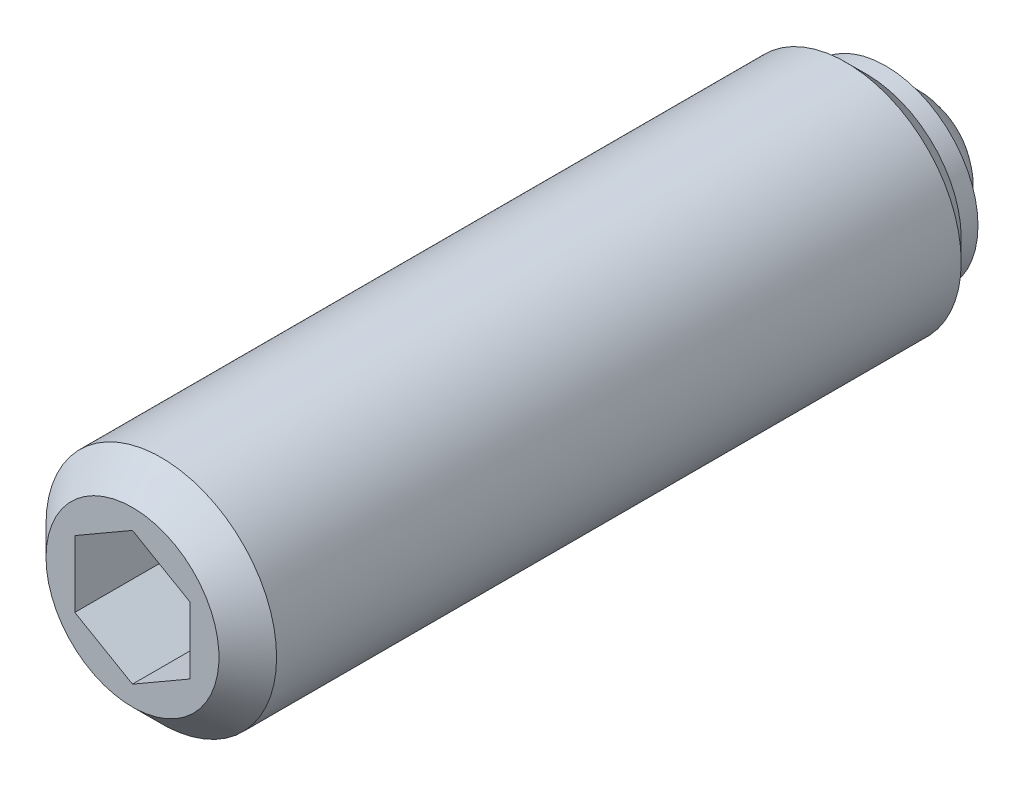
ISO-10303-21;
HEADER;
FILE_DESCRIPTION(('STEP AP214'),'2;1');
FILE_NAME('part.step','',(''),(''),'','','');
FILE_SCHEMA(('AUTOMOTIVE_DESIGN { 1 0 10303 214 1 1 1 1 }'));
ENDSEC;
DATA;
#1=APPLICATION_CONTEXT('core data for automotive mechanical design processes');
#2=APPLICATION_PROTOCOL_DEFINITION('international standard','automotive_design',2000,#1);
#3=PRODUCT_CONTEXT('',#1,'mechanical');
#4=PRODUCT('Part','Part','',(#3));
#5=PRODUCT_RELATED_PRODUCT_CATEGORY('part','',(#4));
#6=PRODUCT_DEFINITION_FORMATION('','',#4);
#7=PRODUCT_DEFINITION_CONTEXT('part definition',#1,'design');
#8=PRODUCT_DEFINITION('design','',#6,#7);
#9=PRODUCT_DEFINITION_SHAPE('','',#8);
#10=(LENGTH_UNIT() NAMED_UNIT(*) SI_UNIT(.MILLI.,.METRE.));
#11=(NAMED_UNIT(*) PLANE_ANGLE_UNIT() SI_UNIT($,.RADIAN.));
#12=(NAMED_UNIT(*) SI_UNIT($,.STERADIAN.) SOLID_ANGLE_UNIT());
#13=UNCERTAINTY_MEASURE_WITH_UNIT(LENGTH_MEASURE(1.E-05),#10,'distance_accuracy_value','');
#14=(GEOMETRIC_REPRESENTATION_CONTEXT(3) GLOBAL_UNCERTAINTY_ASSIGNED_CONTEXT((#13)) GLOBAL_UNIT_ASSIGNED_CONTEXT((#10,
#11,#12)) REPRESENTATION_CONTEXT('',''));
#15=CARTESIAN_POINT('',(0.,0.,0.));
#16=DIRECTION('',(0.,0.,1.));
#17=DIRECTION('',(1.,0.,0.));
#18=AXIS2_PLACEMENT_3D('',#15,#16,#17);
#19=CARTESIAN_POINT('',(0.,0.,34.));
#20=DIRECTION('',(0.,0.,-1.));
#21=DIRECTION('',(-1.,0.,0.));
#22=AXIS2_PLACEMENT_3D('',#19,#20,#21);
#23=PLANE('',#22);
#24=DIRECTION('',(0.,1.,0.));
#25=VECTOR('',#24,1.);
#26=CARTESIAN_POINT('',(-3.,-1.73205080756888,34.));
#27=LINE('',#26,#25);
#28=CARTESIAN_POINT('',(-3.,-1.73205080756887,34.));
#29=VERTEX_POINT('',#28);
#30=CARTESIAN_POINT('',(-3.,1.73205080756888,34.));
#31=VERTEX_POINT('',#30);
#32=EDGE_CURVE('E80',#29,#31,#27,.T.);
#33=ORIENTED_EDGE('',*,*,#32,.F.);
#34=DIRECTION('',(0.866025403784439,-0.5,0.));
#35=VECTOR('',#34,1.);
#36=CARTESIAN_POINT('',(0.,-3.46410161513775,34.));
#37=LINE('',#36,#35);
#38=CARTESIAN_POINT('',(0.,-3.46410161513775,34.));
#39=VERTEX_POINT('',#38);
#40=EDGE_CURVE('E102',#39,#29,#37,.F.);
#41=ORIENTED_EDGE('',*,*,#40,.F.);
#42=DIRECTION('',(-0.866025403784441,-0.5,0.));
#43=VECTOR('',#42,1.);
#44=CARTESIAN_POINT('',(1.5,-2.59807621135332,34.));
#45=LINE('',#44,#43);
#46=CARTESIAN_POINT('',(3.,-1.73205080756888,34.));
#47=VERTEX_POINT('',#46);
#48=EDGE_CURVE('E81',#47,#39,#45,.T.);
#49=ORIENTED_EDGE('',*,*,#48,.F.);
#50=DIRECTION('',(0.,1.,0.));
#51=VECTOR('',#50,1.);
#52=CARTESIAN_POINT('',(3.,0.,34.));
#53=LINE('',#52,#51);
#54=CARTESIAN_POINT('',(3.,1.73205080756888,34.));
#55=VERTEX_POINT('',#54);
#56=EDGE_CURVE('E64',#55,#47,#53,.F.);
#57=ORIENTED_EDGE('',*,*,#56,.F.);
#58=DIRECTION('',(0.866025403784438,-0.5,0.));
#59=VECTOR('',#58,1.);
#60=CARTESIAN_POINT('',(1.5,2.59807621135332,34.));
#61=LINE('',#60,#59);
#62=CARTESIAN_POINT('',(0.,3.46410161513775,34.));
#63=VERTEX_POINT('',#62);
#64=EDGE_CURVE('E67',#63,#55,#61,.T.);
#65=ORIENTED_EDGE('',*,*,#64,.F.);
#66=DIRECTION('',(0.866025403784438,0.5,0.));
#67=VECTOR('',#66,1.);
#68=CARTESIAN_POINT('',(-3.,1.73205080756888,34.));
#69=LINE('',#68,#67);
#70=EDGE_CURVE('E69',#31,#63,#69,.T.);
#71=ORIENTED_EDGE('',*,*,#70,.F.);
#72=EDGE_LOOP('',(#33,#41,#49,#57,#65,#71));
#73=FACE_BOUND('',#72,.T.);
#74=ADVANCED_FACE('F14',(#73),#23,.F.);
#75=CARTESIAN_POINT('',(-3.,-1.73205080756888,34.));
#76=DIRECTION('',(1.,0.,0.));
#77=DIRECTION('',(0.,0.,-1.));
#78=AXIS2_PLACEMENT_3D('',#75,#76,#77);
#79=PLANE('',#78);
#80=ORIENTED_EDGE('',*,*,#32,.T.);
#81=DIRECTION('',(0.,0.,-1.));
#82=VECTOR('',#81,1.);
#83=CARTESIAN_POINT('',(-3.,1.73205080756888,34.));
#84=LINE('',#83,#82);
#85=CARTESIAN_POINT('',(-3.,1.73205080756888,42.));
#86=VERTEX_POINT('',#85);
#87=EDGE_CURVE('E79',#86,#31,#84,.T.);
#88=ORIENTED_EDGE('',*,*,#87,.F.);
#89=DIRECTION('',(0.,1.,0.));
#90=VECTOR('',#89,1.);
#91=CARTESIAN_POINT('',(-3.,0.,42.));
#92=LINE('',#91,#90);
#93=CARTESIAN_POINT('',(-3.,-1.73205080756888,42.));
#94=VERTEX_POINT('',#93);
#95=EDGE_CURVE('E84',#86,#94,#92,.F.);
#96=ORIENTED_EDGE('',*,*,#95,.T.);
#97=DIRECTION('',(0.,0.,-1.));
#98=VECTOR('',#97,1.);
#99=CARTESIAN_POINT('',(-3.,-1.73205080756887,34.));
#100=LINE('',#99,#98);
#101=EDGE_CURVE('E96',#29,#94,#100,.F.);
#102=ORIENTED_EDGE('',*,*,#101,.F.);
#103=EDGE_LOOP('',(#80,#88,#96,#102));
#104=FACE_BOUND('',#103,.T.);
#105=ADVANCED_FACE('F169',(#104),#79,.T.);
#106=CARTESIAN_POINT('',(0.,-3.46410161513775,34.));
#107=DIRECTION('',(0.5,0.866025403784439,0.));
#108=DIRECTION('',(0.866025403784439,-0.5,0.));
#109=AXIS2_PLACEMENT_3D('',#106,#107,#108);
#110=PLANE('',#109);
#111=ORIENTED_EDGE('',*,*,#40,.T.);
#112=ORIENTED_EDGE('',*,*,#101,.T.);
#113=DIRECTION('',(0.86602540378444,-0.5,0.));
#114=VECTOR('',#113,1.);
#115=CARTESIAN_POINT('',(-3.,-1.73205080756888,42.));
#116=LINE('',#115,#114);
#117=CARTESIAN_POINT('',(0.,-3.46410161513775,42.));
#118=VERTEX_POINT('',#117);
#119=EDGE_CURVE('E85',#94,#118,#116,.T.);
#120=ORIENTED_EDGE('',*,*,#119,.T.);
#121=DIRECTION('',(0.,0.,-1.));
#122=VECTOR('',#121,1.);
#123=CARTESIAN_POINT('',(0.,-3.46410161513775,34.));
#124=LINE('',#123,#122);
#125=EDGE_CURVE('E94',#39,#118,#124,.F.);
#126=ORIENTED_EDGE('',*,*,#125,.F.);
#127=EDGE_LOOP('',(#111,#112,#120,#126));
#128=FACE_BOUND('',#127,.T.);
#129=ADVANCED_FACE('F173',(#128),#110,.T.);
#130=CARTESIAN_POINT('',(3.,-1.73205080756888,34.));
#131=DIRECTION('',(-0.5,0.866025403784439,0.));
#132=DIRECTION('',(0.866025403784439,0.5,0.));
#133=AXIS2_PLACEMENT_3D('',#130,#131,#132);
#134=PLANE('',#133);
#135=ORIENTED_EDGE('',*,*,#48,.T.);
#136=ORIENTED_EDGE('',*,*,#125,.T.);
#137=DIRECTION('',(0.86602540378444,0.5,0.));
#138=VECTOR('',#137,1.);
#139=CARTESIAN_POINT('',(0.,-3.46410161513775,42.));
#140=LINE('',#139,#138);
#141=CARTESIAN_POINT('',(3.,-1.73205080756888,42.));
#142=VERTEX_POINT('',#141);
#143=EDGE_CURVE('E108',#118,#142,#140,.T.);
#144=ORIENTED_EDGE('',*,*,#143,.T.);
#145=DIRECTION('',(0.,0.,1.));
#146=VECTOR('',#145,1.);
#147=CARTESIAN_POINT('',(3.,-1.73205080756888,34.));
#148=LINE('',#147,#146);
#149=EDGE_CURVE('E91',#47,#142,#148,.T.);
#150=ORIENTED_EDGE('',*,*,#149,.F.);
#151=EDGE_LOOP('',(#135,#136,#144,#150));
#152=FACE_BOUND('',#151,.T.);
#153=ADVANCED_FACE('F178',(#152),#134,.T.);
#154=CARTESIAN_POINT('',(3.,1.73205080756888,34.));
#155=DIRECTION('',(-1.,0.,0.));
#156=DIRECTION('',(0.,0.,1.));
#157=AXIS2_PLACEMENT_3D('',#154,#155,#156);
#158=PLANE('',#157);
#159=ORIENTED_EDGE('',*,*,#56,.T.);
#160=ORIENTED_EDGE('',*,*,#149,.T.);
#161=DIRECTION('',(0.,1.,0.));
#162=VECTOR('',#161,1.);
#163=CARTESIAN_POINT('',(3.,0.,42.));
#164=LINE('',#163,#162);
#165=CARTESIAN_POINT('',(3.,1.73205080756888,42.));
#166=VERTEX_POINT('',#165);
#167=EDGE_CURVE('E110',#142,#166,#164,.T.);
#168=ORIENTED_EDGE('',*,*,#167,.T.);
#169=DIRECTION('',(0.,0.,-1.));
#170=VECTOR('',#169,1.);
#171=CARTESIAN_POINT('',(3.,1.73205080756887,34.));
#172=LINE('',#171,#170);
#173=EDGE_CURVE('E87',#55,#166,#172,.F.);
#174=ORIENTED_EDGE('',*,*,#173,.F.);
#175=EDGE_LOOP('',(#159,#160,#168,#174));
#176=FACE_BOUND('',#175,.T.);
#177=ADVANCED_FACE('F184',(#176),#158,.T.);
#178=CARTESIAN_POINT('',(0.,3.46410161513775,34.));
#179=DIRECTION('',(-0.5,-0.866025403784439,0.));
#180=DIRECTION('',(-0.866025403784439,0.5,0.));
#181=AXIS2_PLACEMENT_3D('',#178,#179,#180);
#182=PLANE('',#181);
#183=ORIENTED_EDGE('',*,*,#64,.T.);
#184=ORIENTED_EDGE('',*,*,#173,.T.);
#185=DIRECTION('',(-0.86602540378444,0.5,0.));
#186=VECTOR('',#185,1.);
#187=CARTESIAN_POINT('',(3.,1.73205080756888,42.));
#188=LINE('',#187,#186);
#189=CARTESIAN_POINT('',(0.,3.46410161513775,42.));
#190=VERTEX_POINT('',#189);
#191=EDGE_CURVE('E31',#166,#190,#188,.T.);
#192=ORIENTED_EDGE('',*,*,#191,.T.);
#193=DIRECTION('',(0.,0.,-1.));
#194=VECTOR('',#193,1.);
#195=CARTESIAN_POINT('',(0.,3.46410161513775,34.));
#196=LINE('',#195,#194);
#197=EDGE_CURVE('E77',#63,#190,#196,.F.);
#198=ORIENTED_EDGE('',*,*,#197,.F.);
#199=EDGE_LOOP('',(#183,#184,#192,#198));
#200=FACE_BOUND('',#199,.T.);
#201=ADVANCED_FACE('F83',(#200),#182,.T.);
#202=CARTESIAN_POINT('',(-3.,1.73205080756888,34.));
#203=DIRECTION('',(0.5,-0.866025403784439,0.));
#204=DIRECTION('',(-0.866025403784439,-0.5,0.));
#205=AXIS2_PLACEMENT_3D('',#202,#203,#204);
#206=PLANE('',#205);
#207=ORIENTED_EDGE('',*,*,#70,.T.);
#208=ORIENTED_EDGE('',*,*,#197,.T.);
#209=DIRECTION('',(-0.86602540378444,-0.5,0.));
#210=VECTOR('',#209,1.);
#211=CARTESIAN_POINT('',(0.,3.46410161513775,42.));
#212=LINE('',#211,#210);
#213=EDGE_CURVE('E113',#190,#86,#212,.T.);
#214=ORIENTED_EDGE('',*,*,#213,.T.);
#215=ORIENTED_EDGE('',*,*,#87,.T.);
#216=EDGE_LOOP('',(#207,#208,#214,#215));
#217=FACE_BOUND('',#216,.T.);
#218=ADVANCED_FACE('F75',(#217),#206,.T.);
#219=CARTESIAN_POINT('',(0.,0.,42.));
#220=DIRECTION('',(0.,0.,-1.));
#221=DIRECTION('',(-1.,0.,0.));
#222=AXIS2_PLACEMENT_3D('',#219,#220,#221);
#223=PLANE('',#222);
#224=ORIENTED_EDGE('',*,*,#191,.F.);
#225=ORIENTED_EDGE('',*,*,#167,.F.);
#226=ORIENTED_EDGE('',*,*,#143,.F.);
#227=ORIENTED_EDGE('',*,*,#119,.F.);
#228=ORIENTED_EDGE('',*,*,#95,.F.);
#229=ORIENTED_EDGE('',*,*,#213,.F.);
#230=EDGE_LOOP('',(#224,#225,#226,#227,#228,#229));
#231=FACE_BOUND('',#230,.T.);
#232=CARTESIAN_POINT('',(0.,0.,42.));
#233=DIRECTION('',(0.,0.,-1.));
#234=DIRECTION('',(-1.,0.,0.));
#235=AXIS2_PLACEMENT_3D('',#232,#233,#234);
#236=CIRCLE('',#235,4.50000000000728);
#237=CARTESIAN_POINT('',(-4.50000000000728,0.,42.));
#238=VERTEX_POINT('',#237);
#239=EDGE_CURVE('E17',#238,#238,#236,.T.);
#240=ORIENTED_EDGE('',*,*,#239,.F.);
#241=EDGE_LOOP('',(#240));
#242=FACE_BOUND('',#241,.T.);
#243=ADVANCED_FACE('F193',(#231,#242),#223,.F.);
#244=CARTESIAN_POINT('',(0.,0.,40.4999999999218));
#245=DIRECTION('',(0.,0.,-1.));
#246=DIRECTION('',(-1.,0.,0.));
#247=AXIS2_PLACEMENT_3D('',#244,#245,#246);
#248=CONICAL_SURFACE('',#247,6.00000000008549,0.785398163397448);
#249=ORIENTED_EDGE('',*,*,#239,.T.);
#250=EDGE_LOOP('',(#249));
#251=FACE_BOUND('',#250,.T.);
#252=CARTESIAN_POINT('',(0.,0.,40.5));
#253=DIRECTION('',(0.,0.,1.));
#254=DIRECTION('',(1.,0.,0.));
#255=AXIS2_PLACEMENT_3D('',#252,#253,#254);
#256=CIRCLE('',#255,6.);
#257=CARTESIAN_POINT('',(6.,0.,40.5));
#258=VERTEX_POINT('',#257);
#259=EDGE_CURVE('E9',#258,#258,#256,.F.);
#260=ORIENTED_EDGE('',*,*,#259,.F.);
#261=EDGE_LOOP('',(#260));
#262=FACE_BOUND('',#261,.T.);
#263=ADVANCED_FACE('F165',(#251,#262),#248,.T.);
#264=CARTESIAN_POINT('',(0.,0.,26.8));
#265=DIRECTION('',(0.,0.,1.));
#266=DIRECTION('',(1.,0.,0.));
#267=AXIS2_PLACEMENT_3D('',#264,#265,#266);
#268=CYLINDRICAL_SURFACE('',#267,6.);
#269=ORIENTED_EDGE('',*,*,#259,.T.);
#270=EDGE_LOOP('',(#269));
#271=FACE_BOUND('',#270,.T.);
#272=CARTESIAN_POINT('',(0.,0.,4.87350000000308));
#273=DIRECTION('',(0.,0.,1.));
#274=DIRECTION('',(1.,0.,0.));
#275=AXIS2_PLACEMENT_3D('',#272,#273,#274);
#276=CIRCLE('',#275,6.);
#277=CARTESIAN_POINT('',(6.,0.,4.87350000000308));
#278=VERTEX_POINT('',#277);
#279=EDGE_CURVE('E128',#278,#278,#276,.T.);
#280=ORIENTED_EDGE('',*,*,#279,.T.);
#281=EDGE_LOOP('',(#280));
#282=FACE_BOUND('',#281,.T.);
#283=ADVANCED_FACE('F132',(#271,#282),#268,.T.);
#284=CARTESIAN_POINT('',(0.,0.,4.25));
#285=DIRECTION('',(0.,0.,1.));
#286=DIRECTION('',(0.,1.,0.));
#287=AXIS2_PLACEMENT_3D('',#284,#285,#286);
#288=SPHERICAL_SURFACE('',#287,4.25);
#289=CARTESIAN_POINT('',(0.,0.,2.8));
#290=DIRECTION('',(0.,0.,1.));
#291=DIRECTION('',(1.,0.,0.));
#292=AXIS2_PLACEMENT_3D('',#289,#290,#291);
#293=CIRCLE('',#292,3.99499687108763);
#294=CARTESIAN_POINT('',(3.99499687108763,0.,2.8));
#295=VERTEX_POINT('',#294);
#296=EDGE_CURVE('E71',#295,#295,#293,.T.);
#297=ORIENTED_EDGE('',*,*,#296,.F.);
#298=EDGE_LOOP('',(#297));
#299=FACE_BOUND('',#298,.T.);
#300=ADVANCED_FACE('F155',(#299),#288,.T.);
#301=CARTESIAN_POINT('',(0.,3.99499687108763,2.8));
#302=DIRECTION('',(0.,0.,1.));
#303=DIRECTION('',(1.,0.,0.));
#304=AXIS2_PLACEMENT_3D('',#301,#302,#303);
#305=PLANE('',#304);
#306=CARTESIAN_POINT('',(0.,0.,2.8));
#307=DIRECTION('',(0.,0.,1.));
#308=DIRECTION('',(1.,0.,0.));
#309=AXIS2_PLACEMENT_3D('',#306,#307,#308);
#310=CIRCLE('',#309,4.80000000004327);
#311=CARTESIAN_POINT('',(4.80000000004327,0.,2.8));
#312=VERTEX_POINT('',#311);
#313=EDGE_CURVE('E119',#312,#312,#310,.T.);
#314=ORIENTED_EDGE('',*,*,#313,.F.);
#315=EDGE_LOOP('',(#314));
#316=FACE_BOUND('',#315,.T.);
#317=ORIENTED_EDGE('',*,*,#296,.T.);
#318=EDGE_LOOP('',(#317));
#319=FACE_BOUND('',#318,.T.);
#320=ADVANCED_FACE('F149',(#316,#319),#305,.F.);
#321=CARTESIAN_POINT('',(0.,0.,47.3342905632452));
#322=DIRECTION('',(0.,0.,1.));
#323=DIRECTION('',(1.,0.,0.));
#324=AXIS2_PLACEMENT_3D('',#321,#322,#323);
#325=CYLINDRICAL_SURFACE('',#324,4.80000000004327);
#326=CARTESIAN_POINT('',(0.,0.,3.8));
#327=DIRECTION('',(0.,0.,1.));
#328=DIRECTION('',(1.,0.,0.));
#329=AXIS2_PLACEMENT_3D('',#326,#327,#328);
#330=CIRCLE('',#329,4.80000000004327);
#331=CARTESIAN_POINT('',(4.80000000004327,0.,3.8));
#332=VERTEX_POINT('',#331);
#333=EDGE_CURVE('E122',#332,#332,#330,.T.);
#334=ORIENTED_EDGE('',*,*,#333,.F.);
#335=EDGE_LOOP('',(#334));
#336=FACE_BOUND('',#335,.T.);
#337=ORIENTED_EDGE('',*,*,#313,.T.);
#338=EDGE_LOOP('',(#337));
#339=FACE_BOUND('',#338,.T.);
#340=ADVANCED_FACE('F143',(#336,#339),#325,.T.);
#341=CARTESIAN_POINT('',(0.,4.80000000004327,3.8));
#342=DIRECTION('',(0.,0.,1.));
#343=DIRECTION('',(1.,0.,0.));
#344=AXIS2_PLACEMENT_3D('',#341,#342,#343);
#345=PLANE('',#344);
#346=CARTESIAN_POINT('',(0.,0.,3.8));
#347=DIRECTION('',(0.,0.,1.));
#348=DIRECTION('',(1.,0.,0.));
#349=AXIS2_PLACEMENT_3D('',#346,#347,#348);
#350=CIRCLE('',#349,4.92649999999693);
#351=CARTESIAN_POINT('',(4.92649999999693,0.,3.8));
#352=VERTEX_POINT('',#351);
#353=EDGE_CURVE('E125',#352,#352,#350,.T.);
#354=ORIENTED_EDGE('',*,*,#353,.F.);
#355=EDGE_LOOP('',(#354));
#356=FACE_BOUND('',#355,.T.);
#357=ORIENTED_EDGE('',*,*,#333,.T.);
#358=EDGE_LOOP('',(#357));
#359=FACE_BOUND('',#358,.T.);
#360=ADVANCED_FACE('F137',(#356,#359),#345,.F.);
#361=CARTESIAN_POINT('',(0.,0.,3.8));
#362=DIRECTION('',(0.,0.,1.));
#363=DIRECTION('',(1.,0.,0.));
#364=AXIS2_PLACEMENT_3D('',#361,#362,#363);
#365=CONICAL_SURFACE('',#364,4.92649999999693,0.785398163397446);
#366=ORIENTED_EDGE('',*,*,#279,.F.);
#367=EDGE_LOOP('',(#366));
#368=FACE_BOUND('',#367,.T.);
#369=ORIENTED_EDGE('',*,*,#353,.T.);
#370=EDGE_LOOP('',(#369));
#371=FACE_BOUND('',#370,.T.);
#372=ADVANCED_FACE('F134',(#368,#371),#365,.T.);
#373=CLOSED_SHELL('',(#74,#105,#129,#153,#177,#201,#218,#243,#263,#283,#300,#320,#340,#360,#372));
#374=MANIFOLD_SOLID_BREP('B1',#373);
#375=ADVANCED_BREP_SHAPE_REPRESENTATION('',(#18,#374),#14);
#376=SHAPE_DEFINITION_REPRESENTATION(#9,#375);
ENDSEC;
END-ISO-10303-21;
